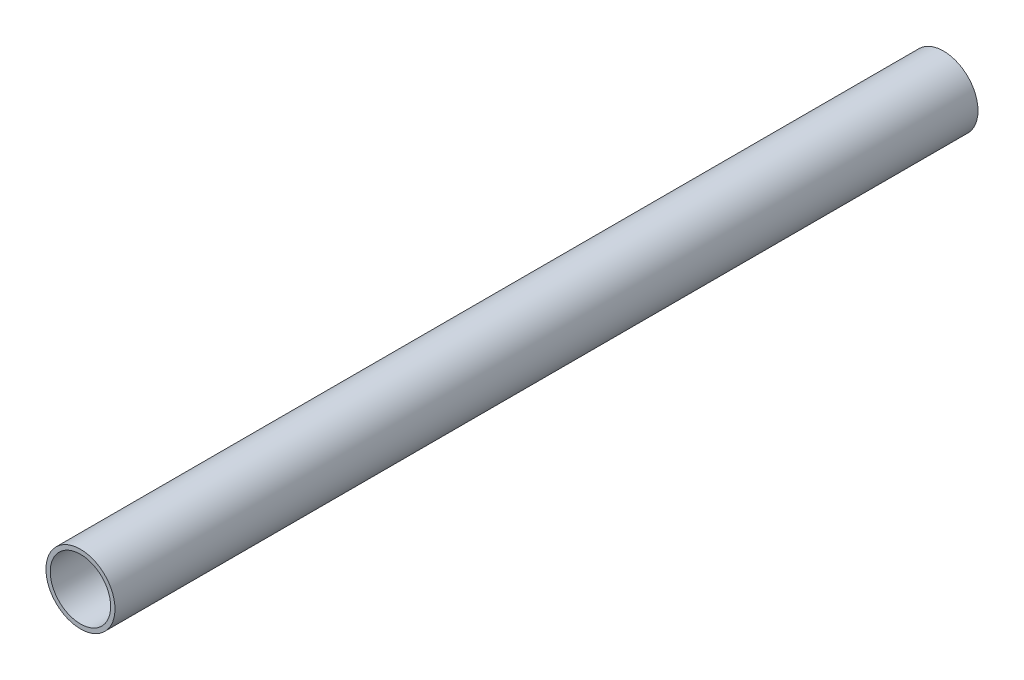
ISO-10303-21;
HEADER;
FILE_DESCRIPTION(('STEP AP214'),'2;1');
FILE_NAME('part.step','',(''),(''),'','','');
FILE_SCHEMA(('AUTOMOTIVE_DESIGN { 1 0 10303 214 1 1 1 1 }'));
ENDSEC;
DATA;
#1=APPLICATION_CONTEXT('core data for automotive mechanical design processes');
#2=APPLICATION_PROTOCOL_DEFINITION('international standard','automotive_design',2000,#1);
#3=PRODUCT_CONTEXT('',#1,'mechanical');
#4=PRODUCT('Part','Part','',(#3));
#5=PRODUCT_RELATED_PRODUCT_CATEGORY('part','',(#4));
#6=PRODUCT_DEFINITION_FORMATION('','',#4);
#7=PRODUCT_DEFINITION_CONTEXT('part definition',#1,'design');
#8=PRODUCT_DEFINITION('design','',#6,#7);
#9=PRODUCT_DEFINITION_SHAPE('','',#8);
#10=(LENGTH_UNIT() NAMED_UNIT(*) SI_UNIT(.MILLI.,.METRE.));
#11=(NAMED_UNIT(*) PLANE_ANGLE_UNIT() SI_UNIT($,.RADIAN.));
#12=(NAMED_UNIT(*) SI_UNIT($,.STERADIAN.) SOLID_ANGLE_UNIT());
#13=UNCERTAINTY_MEASURE_WITH_UNIT(LENGTH_MEASURE(1.E-05),#10,'distance_accuracy_value','');
#14=(GEOMETRIC_REPRESENTATION_CONTEXT(3) GLOBAL_UNCERTAINTY_ASSIGNED_CONTEXT((#13)) GLOBAL_UNIT_ASSIGNED_CONTEXT((#10,
#11,#12)) REPRESENTATION_CONTEXT('',''));
#15=CARTESIAN_POINT('',(0.,0.,0.));
#16=DIRECTION('',(0.,0.,1.));
#17=DIRECTION('',(1.,0.,0.));
#18=AXIS2_PLACEMENT_3D('',#15,#16,#17);
#19=CARTESIAN_POINT('',(0.,0.,200.));
#20=DIRECTION('',(0.,0.,1.));
#21=DIRECTION('',(1.,0.,0.));
#22=AXIS2_PLACEMENT_3D('',#19,#20,#21);
#23=PLANE('',#22);
#24=CARTESIAN_POINT('',(0.,0.,200.));
#25=DIRECTION('',(0.,0.,1.));
#26=DIRECTION('',(1.,0.,0.));
#27=AXIS2_PLACEMENT_3D('',#24,#25,#26);
#28=CIRCLE('',#27,8.);
#29=CARTESIAN_POINT('',(8.,0.,200.));
#30=VERTEX_POINT('',#29);
#31=EDGE_CURVE('E10',#30,#30,#28,.T.);
#32=ORIENTED_EDGE('',*,*,#31,.T.);
#33=EDGE_LOOP('',(#32));
#34=FACE_BOUND('',#33,.T.);
#35=CARTESIAN_POINT('',(0.,0.,200.));
#36=DIRECTION('',(0.,0.,1.));
#37=DIRECTION('',(1.,0.,0.));
#38=AXIS2_PLACEMENT_3D('',#35,#36,#37);
#39=CIRCLE('',#38,7.);
#40=CARTESIAN_POINT('',(7.,0.,200.));
#41=VERTEX_POINT('',#40);
#42=EDGE_CURVE('E50',#41,#41,#39,.T.);
#43=ORIENTED_EDGE('',*,*,#42,.F.);
#44=EDGE_LOOP('',(#43));
#45=FACE_BOUND('',#44,.T.);
#46=ADVANCED_FACE('F37',(#34,#45),#23,.T.);
#47=CARTESIAN_POINT('',(0.,0.,0.));
#48=DIRECTION('',(0.,0.,1.));
#49=DIRECTION('',(1.,0.,0.));
#50=AXIS2_PLACEMENT_3D('',#47,#48,#49);
#51=PLANE('',#50);
#52=CARTESIAN_POINT('',(0.,0.,0.));
#53=DIRECTION('',(0.,0.,1.));
#54=DIRECTION('',(1.,0.,0.));
#55=AXIS2_PLACEMENT_3D('',#52,#53,#54);
#56=CIRCLE('',#55,8.);
#57=CARTESIAN_POINT('',(8.,0.,0.));
#58=VERTEX_POINT('',#57);
#59=EDGE_CURVE('E41',#58,#58,#56,.T.);
#60=ORIENTED_EDGE('',*,*,#59,.F.);
#61=EDGE_LOOP('',(#60));
#62=FACE_BOUND('',#61,.T.);
#63=CARTESIAN_POINT('',(0.,0.,0.));
#64=DIRECTION('',(0.,0.,1.));
#65=DIRECTION('',(1.,0.,0.));
#66=AXIS2_PLACEMENT_3D('',#63,#64,#65);
#67=CIRCLE('',#66,7.);
#68=CARTESIAN_POINT('',(7.,0.,0.));
#69=VERTEX_POINT('',#68);
#70=EDGE_CURVE('E52',#69,#69,#67,.T.);
#71=ORIENTED_EDGE('',*,*,#70,.T.);
#72=EDGE_LOOP('',(#71));
#73=FACE_BOUND('',#72,.T.);
#74=ADVANCED_FACE('F64',(#62,#73),#51,.F.);
#75=CARTESIAN_POINT('',(0.,0.,200.));
#76=DIRECTION('',(0.,0.,-1.));
#77=DIRECTION('',(-1.,0.,0.));
#78=AXIS2_PLACEMENT_3D('',#75,#76,#77);
#79=CYLINDRICAL_SURFACE('',#78,8.);
#80=ORIENTED_EDGE('',*,*,#31,.F.);
#81=EDGE_LOOP('',(#80));
#82=FACE_BOUND('',#81,.T.);
#83=ORIENTED_EDGE('',*,*,#59,.T.);
#84=EDGE_LOOP('',(#83));
#85=FACE_BOUND('',#84,.T.);
#86=ADVANCED_FACE('F39',(#82,#85),#79,.T.);
#87=CARTESIAN_POINT('',(0.,0.,200.));
#88=DIRECTION('',(0.,0.,-1.));
#89=DIRECTION('',(-1.,0.,0.));
#90=AXIS2_PLACEMENT_3D('',#87,#88,#89);
#91=CYLINDRICAL_SURFACE('',#90,7.);
#92=ORIENTED_EDGE('',*,*,#42,.T.);
#93=EDGE_LOOP('',(#92));
#94=FACE_BOUND('',#93,.T.);
#95=ORIENTED_EDGE('',*,*,#70,.F.);
#96=EDGE_LOOP('',(#95));
#97=FACE_BOUND('',#96,.T.);
#98=ADVANCED_FACE('F60',(#94,#97),#91,.F.);
#99=CLOSED_SHELL('',(#46,#74,#86,#98));
#100=MANIFOLD_SOLID_BREP('B2',#99);
#101=ADVANCED_BREP_SHAPE_REPRESENTATION('',(#18,#100),#14);
#102=SHAPE_DEFINITION_REPRESENTATION(#9,#101);
ENDSEC;
END-ISO-10303-21;
